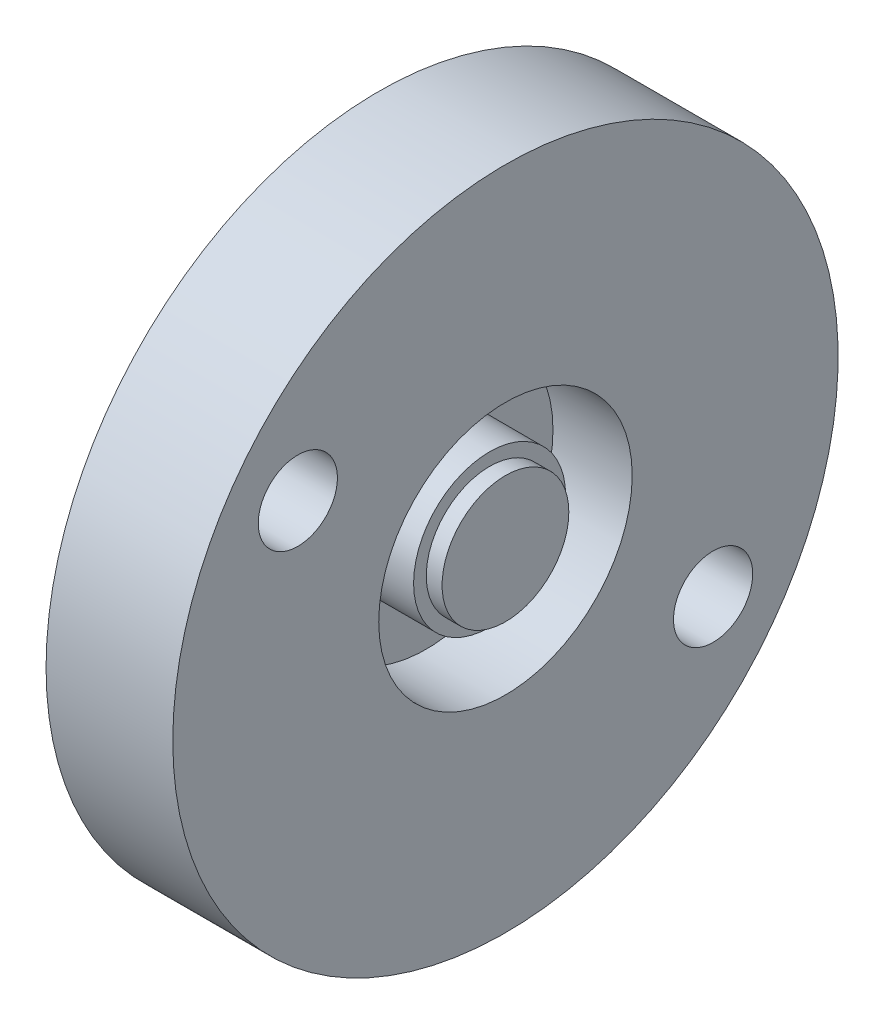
from build123d import *

# Parameters (mm, degrees)
SKETCH1_R      = 13.335
EXTRUDE1_DEPTH = 5.08
HOLE1_D        = 10.16
HOLE1_DEPTH    = 3.175
SKETCH4_R      = 3.048
EXTRUDE2_DEPTH = 2.54
SKETCH5_R      = 2.54
EXTRUDE3_DEPTH = 0.635
HOLE2_D        = 3.175
HOLE2_DEPTH    = 2.54
HOLE3_D        = 3.175
HOLE3_DEPTH    = 2.54


with BuildPart() as part:
    # Sketch1 → Extrude1 (new body)
    with BuildSketch(Plane(origin=(2.54, 0, 0), x_dir=(0, 0, -1), z_dir=(1, 0, 0))):
        with Locations(Location((0, 0, 0), (0, 0, 180))):
            Circle(SKETCH1_R)
    extrude(amount=-EXTRUDE1_DEPTH)

    # Hole1
    with Locations(Plane(origin=(2.54, 0, 0), x_dir=(0, 0, -1), z_dir=(1, 0, 0))):
        with Locations((0, 0)):
            Hole(HOLE1_D / 2, depth=HOLE1_DEPTH)

    # Sketch4 → Extrude2 (add)
    with BuildSketch(Plane(origin=(-0.635, 0, 0), x_dir=(0, 0, -1), z_dir=(1, 0, 0))):
        with Locations(Location((0, 0, 0), (0, 0, 180))):
            Circle(SKETCH4_R)
    extrude(amount=EXTRUDE2_DEPTH)

    # Sketch5 → Extrude3 (add)
    with BuildSketch(Plane(origin=(1.905, 0, 0), x_dir=(0, 0, -1), z_dir=(1, 0, 0))):
        Circle(SKETCH5_R)
    extrude(amount=EXTRUDE3_DEPTH)

    # Hole2
    with Locations(Plane(origin=(2.54, 0, 0), x_dir=(0, 0, -1), z_dir=(1, 0, 0))):
        with Locations((-8.32258477, 5.827536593)):
            Hole(HOLE2_D / 2, depth=HOLE2_DEPTH)

    # Hole3
    with Locations(Plane(origin=(2.54, 0, 0), x_dir=(0, 0, -1), z_dir=(1, 0, 0))):
        with Locations((8.32258477, -5.827536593)):
            Hole(HOLE3_D / 2, depth=HOLE3_DEPTH)


solid = part.part
